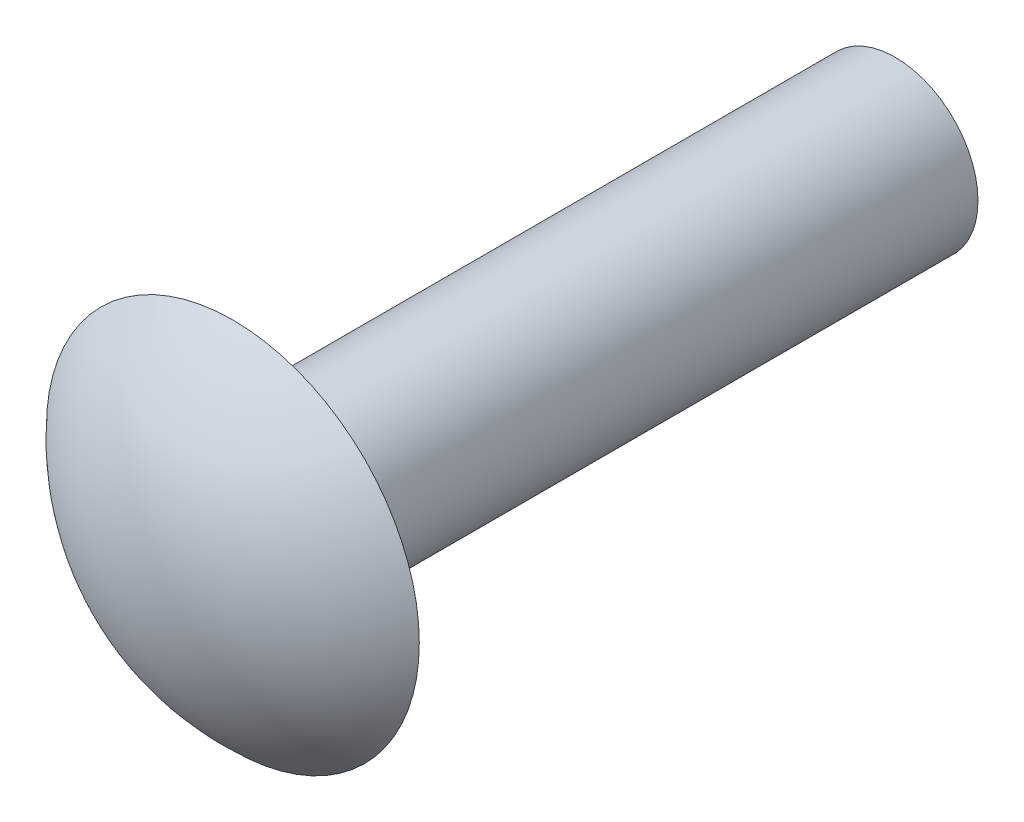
from build123d import *


with BuildPart() as part:
    # BaseBodySke → BaseBody (revolve)
    with BuildSketch(Plane(origin=(0, 0, 0), x_dir=(1, 0, 0), z_dir=(0, 1, 0))):
        with BuildLine():
            Line((-7.1501, 3.175), (-3.175, 3.175))
            Line((-3.175, 3.175), (-3.175, 28.575))
            Line((-3.175, 28.575), (0, 28.575))
            Line((0, 28.575), (0, 0))
            ThreePointArc((0, 0), (-3.911667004, 0.829438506), (-7.1501, 3.175))
        make_face()
    revolve(axis=Axis((0, 0, 0), (0, 0, -1)))


solid = part.part
